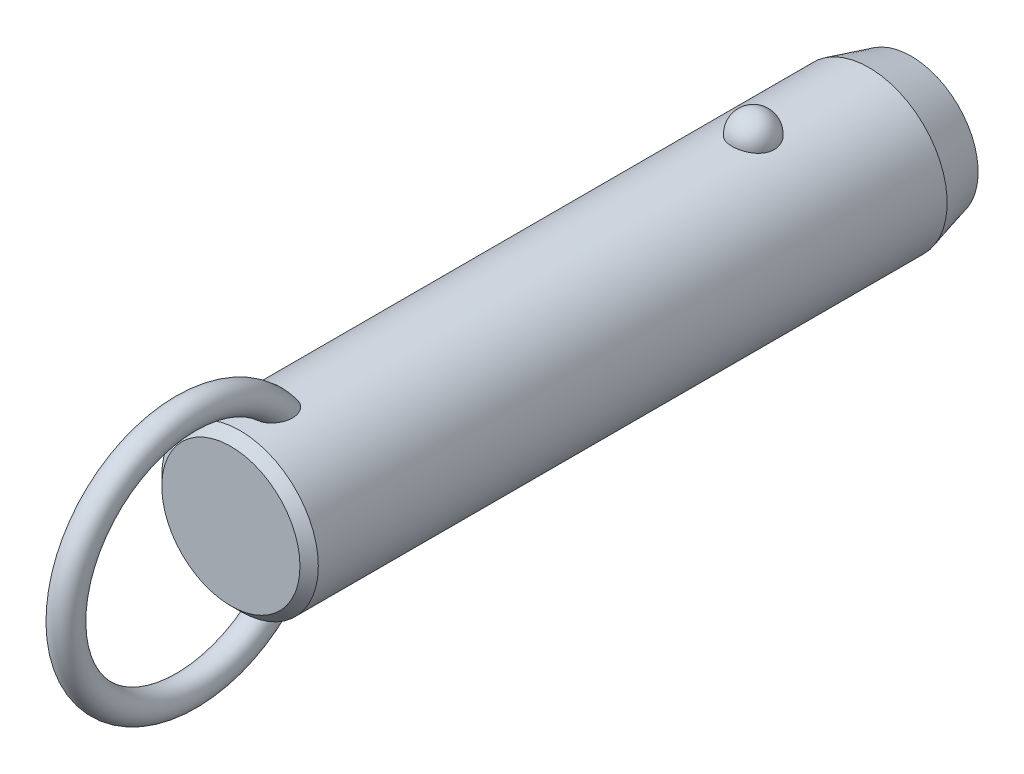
ISO-10303-21;
HEADER;
FILE_DESCRIPTION(('STEP AP214'),'2;1');
FILE_NAME('part.step','',(''),(''),'','','');
FILE_SCHEMA(('AUTOMOTIVE_DESIGN { 1 0 10303 214 1 1 1 1 }'));
ENDSEC;
DATA;
#1=APPLICATION_CONTEXT('core data for automotive mechanical design processes');
#2=APPLICATION_PROTOCOL_DEFINITION('international standard','automotive_design',2000,#1);
#3=PRODUCT_CONTEXT('',#1,'mechanical');
#4=PRODUCT('Part','Part','',(#3));
#5=PRODUCT_RELATED_PRODUCT_CATEGORY('part','',(#4));
#6=PRODUCT_DEFINITION_FORMATION('','',#4);
#7=PRODUCT_DEFINITION_CONTEXT('part definition',#1,'design');
#8=PRODUCT_DEFINITION('design','',#6,#7);
#9=PRODUCT_DEFINITION_SHAPE('','',#8);
#10=(LENGTH_UNIT() NAMED_UNIT(*) SI_UNIT(.MILLI.,.METRE.));
#11=(NAMED_UNIT(*) PLANE_ANGLE_UNIT() SI_UNIT($,.RADIAN.));
#12=(NAMED_UNIT(*) SI_UNIT($,.STERADIAN.) SOLID_ANGLE_UNIT());
#13=UNCERTAINTY_MEASURE_WITH_UNIT(LENGTH_MEASURE(1.E-05),#10,'distance_accuracy_value','');
#14=(GEOMETRIC_REPRESENTATION_CONTEXT(3) GLOBAL_UNCERTAINTY_ASSIGNED_CONTEXT((#13)) GLOBAL_UNIT_ASSIGNED_CONTEXT((#10,
#11,#12)) REPRESENTATION_CONTEXT('',''));
#15=CARTESIAN_POINT('',(0.,0.,0.));
#16=DIRECTION('',(0.,0.,1.));
#17=DIRECTION('',(1.,0.,0.));
#18=AXIS2_PLACEMENT_3D('',#15,#16,#17);
#19=CARTESIAN_POINT('',(0.,0.,58.4));
#20=DIRECTION('',(0.,0.,-1.));
#21=DIRECTION('',(-1.,0.,0.));
#22=AXIS2_PLACEMENT_3D('',#19,#20,#21);
#23=CYLINDRICAL_SURFACE('',#22,11.1);
#24=CARTESIAN_POINT('',(2.9724815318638,10.6945945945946,-3.));
#25=CARTESIAN_POINT('',(2.97247830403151,10.6945972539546,-2.83225059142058));
#26=CARTESIAN_POINT('',(2.95876598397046,10.6984356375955,-2.66445972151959));
#27=CARTESIAN_POINT('',(2.90424529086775,10.7133624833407,-2.33362381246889));
#28=CARTESIAN_POINT('',(2.8634252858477,10.7244540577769,-2.1705808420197));
#29=CARTESIAN_POINT('',(2.75573657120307,10.7526272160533,-1.85396767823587));
#30=CARTESIAN_POINT('',(2.68887937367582,10.7697061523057,-1.70039333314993));
#31=CARTESIAN_POINT('',(2.53079696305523,10.8079438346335,-1.40691598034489));
#32=CARTESIAN_POINT('',(2.43957264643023,10.8291024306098,-1.2670124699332));
#33=CARTESIAN_POINT('',(2.23458150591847,10.8732541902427,-1.00409565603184));
#34=CARTESIAN_POINT('',(2.12071295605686,10.8962553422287,-0.881162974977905));
#35=CARTESIAN_POINT('',(1.87365402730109,10.9414421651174,-0.656352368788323));
#36=CARTESIAN_POINT('',(1.74046358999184,10.9636278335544,-0.554474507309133));
#37=CARTESIAN_POINT('',(1.45872188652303,11.0046495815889,-0.374872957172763));
#38=CARTESIAN_POINT('',(1.31021276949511,11.0234944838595,-0.297085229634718));
#39=CARTESIAN_POINT('',(1.00170030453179,11.0557957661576,-0.167529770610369));
#40=CARTESIAN_POINT('',(0.841698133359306,11.0692526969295,-0.115759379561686));
#41=CARTESIAN_POINT('',(0.517607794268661,11.0890932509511,-0.0403925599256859));
#42=CARTESIAN_POINT('',(0.353633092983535,11.0955916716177,-0.0163383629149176));
#43=CARTESIAN_POINT('',(0.0238420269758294,11.1011989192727,0.0044517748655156));
#44=CARTESIAN_POINT('',(-0.141974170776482,11.1003084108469,0.00119017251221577));
#45=CARTESIAN_POINT('',(-0.468405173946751,11.0912990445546,-0.0323233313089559));
#46=CARTESIAN_POINT('',(-0.629059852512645,11.0832767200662,-0.0622147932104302));
#47=CARTESIAN_POINT('',(-0.942937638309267,11.0609962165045,-0.147645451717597));
#48=CARTESIAN_POINT('',(-1.09616062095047,11.0467379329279,-0.203185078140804));
#49=CARTESIAN_POINT('',(-1.39181061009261,11.0134071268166,-0.3387529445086));
#50=CARTESIAN_POINT('',(-1.53417383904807,10.9943086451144,-0.418913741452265));
#51=CARTESIAN_POINT('',(-1.80342160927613,10.9533667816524,-0.60144882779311));
#52=CARTESIAN_POINT('',(-1.9303046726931,10.9315231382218,-0.703825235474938));
#53=CARTESIAN_POINT('',(-2.16747598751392,10.887005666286,-0.930091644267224));
#54=CARTESIAN_POINT('',(-2.27742774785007,10.8643239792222,-1.05433291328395));
#55=CARTESIAN_POINT('',(-2.47517316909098,10.8209886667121,-1.31966633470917));
#56=CARTESIAN_POINT('',(-2.56296538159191,10.8003351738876,-1.46075958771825));
#57=CARTESIAN_POINT('',(-2.71500300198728,10.7631304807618,-1.75753646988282));
#58=CARTESIAN_POINT('',(-2.77898901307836,10.7466250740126,-1.91335887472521));
#59=CARTESIAN_POINT('',(-2.88046189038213,10.7198747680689,-2.2339152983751));
#60=CARTESIAN_POINT('',(-2.91794947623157,10.709629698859,-2.39864907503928));
#61=CARTESIAN_POINT('',(-2.96537819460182,10.6965949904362,-2.73165170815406));
#62=CARTESIAN_POINT('',(-2.97542891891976,10.693775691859,-2.89990378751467));
#63=CARTESIAN_POINT('',(-2.96804271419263,10.6958279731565,-3.235752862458));
#64=CARTESIAN_POINT('',(-2.95060646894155,10.7006993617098,-3.40334987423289));
#65=CARTESIAN_POINT('',(-2.88883358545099,10.71753912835,-3.73233906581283));
#66=CARTESIAN_POINT('',(-2.84462026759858,10.7294749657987,-3.89375610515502));
#67=CARTESIAN_POINT('',(-2.73050447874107,10.7590797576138,-4.20667949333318));
#68=CARTESIAN_POINT('',(-2.66060103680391,10.7767489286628,-4.35818546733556));
#69=CARTESIAN_POINT('',(-2.49642559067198,10.8159599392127,-4.6478542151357));
#70=CARTESIAN_POINT('',(-2.40203047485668,10.8375211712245,-4.78594458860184));
#71=CARTESIAN_POINT('',(-2.19143488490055,10.8820570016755,-5.0441038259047));
#72=CARTESIAN_POINT('',(-2.07523364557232,10.9050316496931,-5.16417205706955));
#73=CARTESIAN_POINT('',(-1.82361254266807,10.9499219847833,-5.38334833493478));
#74=CARTESIAN_POINT('',(-1.68812945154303,10.9718338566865,-5.48238464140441));
#75=CARTESIAN_POINT('',(-1.40191298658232,11.0120611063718,-5.65618873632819));
#76=CARTESIAN_POINT('',(-1.25118062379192,11.0303767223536,-5.73095813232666));
#77=CARTESIAN_POINT('',(-0.940570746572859,11.0611653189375,-5.85334725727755));
#78=CARTESIAN_POINT('',(-0.780821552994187,11.0737044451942,-5.90127578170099));
#79=CARTESIAN_POINT('',(-0.455204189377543,11.0918598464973,-5.96992976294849));
#80=CARTESIAN_POINT('',(-0.289336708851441,11.0974768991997,-5.99065827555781));
#81=CARTESIAN_POINT('',(0.0406846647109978,11.1011307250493,-6.00418773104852));
#82=CARTESIAN_POINT('',(0.204817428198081,11.099299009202,-5.99747318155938));
#83=CARTESIAN_POINT('',(0.5295530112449,11.088551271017,-5.9574031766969));
#84=CARTESIAN_POINT('',(0.69015594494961,11.0796354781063,-5.92404858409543));
#85=CARTESIAN_POINT('',(1.0027760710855,11.0557204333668,-5.83180084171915));
#86=CARTESIAN_POINT('',(1.15482001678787,11.0407414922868,-5.77299291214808));
#87=CARTESIAN_POINT('',(1.44678373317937,11.0062913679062,-5.63147366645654));
#88=CARTESIAN_POINT('',(1.58670279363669,10.9868199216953,-5.54876095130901));
#89=CARTESIAN_POINT('',(1.8527023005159,10.9451315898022,-5.36027644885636));
#90=CARTESIAN_POINT('',(1.97855158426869,10.9228788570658,-5.25418644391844));
#91=CARTESIAN_POINT('',(2.21080872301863,10.8782509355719,-5.02251354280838));
#92=CARTESIAN_POINT('',(2.31721312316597,10.8558757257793,-4.89692718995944));
#93=CARTESIAN_POINT('',(2.5094551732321,10.8130715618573,-4.62745408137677));
#94=CARTESIAN_POINT('',(2.59493284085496,10.7926798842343,-4.48330448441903));
#95=CARTESIAN_POINT('',(2.740862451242,10.7565495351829,-4.18236358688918));
#96=CARTESIAN_POINT('',(2.80132490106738,10.7408089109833,-4.02557762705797));
#97=CARTESIAN_POINT('',(2.88959070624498,10.7173718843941,-3.72475308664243));
#98=CARTESIAN_POINT('',(2.92062102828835,10.7088950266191,-3.58171216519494));
#99=CARTESIAN_POINT('',(2.96206765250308,10.6975052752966,-3.29245795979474));
#100=CARTESIAN_POINT('',(2.97248434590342,10.6945922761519,-3.14624473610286));
#101=CARTESIAN_POINT('',(2.9724815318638,10.6945945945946,-3.));
#102=B_SPLINE_CURVE_WITH_KNOTS('',3,(#24,#25,#26,#27,#28,#29,#30,#31,#32,#33,#34,#35,#36,#37,
#38,#39,#40,#41,#42,#43,#44,#45,#46,#47,#48,#49,#50,#51,#52,#53,#54,#55,#56,#57,#58,#59,#60,#61,
#62,#63,#64,#65,#66,#67,#68,#69,#70,#71,#72,#73,#74,#75,#76,#77,#78,#79,#80,#81,#82,#83,#84,#85,
#86,#87,#88,#89,#90,#91,#92,#93,#94,#95,#96,#97,#98,#99,#100,#101),.UNSPECIFIED.,.T.,.F.,(4,2,2,
2,2,2,2,2,2,2,2,2,2,2,2,2,2,2,2,2,2,2,2,2,2,2,2,2,2,2,2,2,2,2,2,2,2,2,4),(0.,0.502722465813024,
1.00566079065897,1.5083769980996,2.01107471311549,2.51608392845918,3.02109467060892,
3.52475118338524,4.02835620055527,4.523518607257,5.0186364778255,5.50715297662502,
5.9956776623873,6.48688002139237,6.97812923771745,7.47814366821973,7.9781907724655,
8.48353712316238,8.9888697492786,9.49218093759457,9.99547960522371,10.4964777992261,
10.997494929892,11.5010810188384,12.0046847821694,12.5099796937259,13.0152411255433,
13.5145635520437,14.0138298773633,14.5043200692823,14.9947943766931,15.4836390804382,
15.9725123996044,16.4685040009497,16.9645836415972,17.4686765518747,17.972557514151,
18.410841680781,18.849117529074),.UNSPECIFIED.);
#103=CARTESIAN_POINT('',(2.9724815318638,10.6945945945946,-3.));
#104=VERTEX_POINT('',#103);
#105=EDGE_CURVE('E41',#104,#104,#102,.T.);
#106=ORIENTED_EDGE('',*,*,#105,.T.);
#107=EDGE_LOOP('',(#106));
#108=FACE_BOUND('',#107,.T.);
#109=CARTESIAN_POINT('',(0.,0.,69.8));
#110=DIRECTION('',(0.,0.,1.));
#111=DIRECTION('',(1.,0.,0.));
#112=AXIS2_PLACEMENT_3D('',#109,#110,#111);
#113=CIRCLE('',#112,11.1);
#114=CARTESIAN_POINT('',(11.1,0.,69.8));
#115=VERTEX_POINT('',#114);
#116=EDGE_CURVE('E10',#115,#115,#113,.F.);
#117=ORIENTED_EDGE('',*,*,#116,.T.);
#118=EDGE_LOOP('',(#117));
#119=FACE_BOUND('',#118,.T.);
#120=CARTESIAN_POINT('',(-0.564520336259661,-11.0856356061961,62.0578154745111));
#121=CARTESIAN_POINT('',(-0.667202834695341,-11.0804062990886,62.0912839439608));
#122=CARTESIAN_POINT('',(-0.766875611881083,-11.0738877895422,62.1338357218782));
#123=CARTESIAN_POINT('',(-0.957284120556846,-11.0590576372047,62.2354190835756));
#124=CARTESIAN_POINT('',(-1.04801616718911,-11.0507452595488,62.2944574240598));
#125=CARTESIAN_POINT('',(-1.21800952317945,-11.0333016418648,62.4265293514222));
#126=CARTESIAN_POINT('',(-1.29730805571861,-11.0241732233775,62.4995156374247));
#127=CARTESIAN_POINT('',(-1.44337665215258,-11.0060026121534,62.6570374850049));
#128=CARTESIAN_POINT('',(-1.51014622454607,-10.9969604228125,62.7415734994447));
#129=CARTESIAN_POINT('',(-1.63454620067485,-10.9791841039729,62.9255213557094));
#130=CARTESIAN_POINT('',(-1.69127003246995,-10.9705107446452,63.0255493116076));
#131=CARTESIAN_POINT('',(-1.78980785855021,-10.9548648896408,63.2327902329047));
#132=CARTESIAN_POINT('',(-1.83161214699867,-10.9478935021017,63.3400078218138));
#133=CARTESIAN_POINT('',(-1.91557028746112,-10.9335803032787,63.6054080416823));
#134=CARTESIAN_POINT('',(-1.95040620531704,-10.9273269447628,63.7659806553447));
#135=CARTESIAN_POINT('',(-1.99388326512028,-10.9194709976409,64.0906977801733));
#136=CARTESIAN_POINT('',(-2.00248051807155,-10.9178762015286,64.2548478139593));
#137=CARTESIAN_POINT('',(-1.99551615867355,-10.9191578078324,64.6246504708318));
#138=CARTESIAN_POINT('',(-1.9732206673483,-10.9232807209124,64.8301911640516));
#139=CARTESIAN_POINT('',(-1.91529761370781,-10.9335244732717,65.133595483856));
#140=CARTESIAN_POINT('',(-1.8918457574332,-10.9376266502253,65.2340883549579));
#141=CARTESIAN_POINT('',(-1.83700674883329,-10.9469720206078,65.432855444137));
#142=CARTESIAN_POINT('',(-1.80562070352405,-10.9522150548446,65.5311299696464));
#143=CARTESIAN_POINT('',(-1.73463055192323,-10.9636837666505,65.7259148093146));
#144=CARTESIAN_POINT('',(-1.69493416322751,-10.9699202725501,65.8223907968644));
#145=CARTESIAN_POINT('',(-1.60745141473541,-10.9830806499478,66.0116262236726));
#146=CARTESIAN_POINT('',(-1.55966150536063,-10.9900048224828,66.1043840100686));
#147=CARTESIAN_POINT('',(-1.45591812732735,-11.0042280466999,66.2846907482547));
#148=CARTESIAN_POINT('',(-1.40000013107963,-11.0115253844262,66.3722601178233));
#149=CARTESIAN_POINT('',(-1.27937470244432,-11.0261911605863,66.5410298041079));
#150=CARTESIAN_POINT('',(-1.21467835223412,-11.0335594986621,66.6222379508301));
#151=CARTESIAN_POINT('',(-1.08218150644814,-11.0473027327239,66.7690010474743));
#152=CARTESIAN_POINT('',(-1.01522633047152,-11.0537063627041,66.835309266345));
#153=CARTESIAN_POINT('',(-0.872952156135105,-11.065850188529,66.9583780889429));
#154=CARTESIAN_POINT('',(-0.797642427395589,-11.0715911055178,67.0151491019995));
#155=CARTESIAN_POINT('',(-0.651396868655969,-11.081071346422,67.1075155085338));
#156=CARTESIAN_POINT('',(-0.58171263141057,-11.0849841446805,67.1450491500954));
#157=CARTESIAN_POINT('',(-0.437066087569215,-11.0916271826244,67.2082594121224));
#158=CARTESIAN_POINT('',(-0.362109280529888,-11.0943586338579,67.2339481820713));
#159=CARTESIAN_POINT('',(-0.207828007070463,-11.0983242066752,67.271117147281));
#160=CARTESIAN_POINT('',(-0.128467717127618,-11.0995432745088,67.2824545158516));
#161=CARTESIAN_POINT('',(0.0309101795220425,-11.1002423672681,67.2889658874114));
#162=CARTESIAN_POINT('',(0.110927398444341,-11.0997233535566,67.2841488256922));
#163=CARTESIAN_POINT('',(0.256406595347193,-11.097240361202,67.2609599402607));
#164=CARTESIAN_POINT('',(0.322235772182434,-11.0955074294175,67.2447543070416));
#165=CARTESIAN_POINT('',(0.450635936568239,-11.0910350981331,67.2026008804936));
#166=CARTESIAN_POINT('',(0.513205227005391,-11.0882951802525,67.1766480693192));
#167=CARTESIAN_POINT('',(0.662626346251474,-11.0805620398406,67.1026073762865));
#168=CARTESIAN_POINT('',(0.747127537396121,-11.0751144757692,67.0498452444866));
#169=CARTESIAN_POINT('',(0.906756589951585,-11.0631932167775,66.9317206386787));
#170=CARTESIAN_POINT('',(0.981859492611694,-11.0567168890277,66.8663257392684));
#171=CARTESIAN_POINT('',(1.10712207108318,-11.0447856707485,66.7422633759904));
#172=CARTESIAN_POINT('',(1.15909566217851,-11.0394280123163,66.6853831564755));
#173=CARTESIAN_POINT('',(1.25791923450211,-11.0286040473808,66.5673271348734));
#174=CARTESIAN_POINT('',(1.3047664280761,-11.0231376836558,66.5061490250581));
#175=CARTESIAN_POINT('',(1.43818612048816,-11.0068027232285,66.317305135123));
#176=CARTESIAN_POINT('',(1.5175176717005,-10.9960104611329,66.1844531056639));
#177=CARTESIAN_POINT('',(1.63597546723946,-10.9788847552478,65.9531371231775));
#178=CARTESIAN_POINT('',(1.67988876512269,-10.9722190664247,65.8570530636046));
#179=CARTESIAN_POINT('',(1.75953241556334,-10.9597298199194,65.6614311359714));
#180=CARTESIAN_POINT('',(1.79525967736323,-10.9539065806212,65.5618919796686));
#181=CARTESIAN_POINT('',(1.85844731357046,-10.9433632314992,65.3602111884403));
#182=CARTESIAN_POINT('',(1.88591073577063,-10.9386427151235,65.2580705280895));
#183=CARTESIAN_POINT('',(1.9323432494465,-10.9305350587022,65.0518191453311));
#184=CARTESIAN_POINT('',(1.95131065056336,-10.9271481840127,64.9477080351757));
#185=CARTESIAN_POINT('',(1.99040203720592,-10.9201183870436,64.6654588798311));
#186=CARTESIAN_POINT('',(2.00221217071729,-10.9179256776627,64.4860370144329));
#187=CARTESIAN_POINT('',(1.99711676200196,-10.9188636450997,64.1277133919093));
#188=CARTESIAN_POINT('',(1.98026150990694,-10.9219849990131,63.948811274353));
#189=CARTESIAN_POINT('',(1.92151657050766,-10.9324473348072,63.6364514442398));
#190=CARTESIAN_POINT('',(1.88605081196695,-10.9386915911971,63.5017594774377));
#191=CARTESIAN_POINT('',(1.7939302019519,-10.9541780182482,63.2399669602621));
#192=CARTESIAN_POINT('',(1.73729868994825,-10.9634168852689,63.1128582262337));
#193=CARTESIAN_POINT('',(1.61237037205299,-10.9824218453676,62.8894184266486));
#194=CARTESIAN_POINT('',(1.54715374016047,-10.9918945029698,62.7913455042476));
#195=CARTESIAN_POINT('',(1.40127026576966,-11.0114415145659,62.6074341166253));
#196=CARTESIAN_POINT('',(1.32060742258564,-11.0215157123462,62.5215924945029));
#197=CARTESIAN_POINT('',(1.14474787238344,-11.041168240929,62.3651630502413));
#198=CARTESIAN_POINT('',(1.04947805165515,-11.0507437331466,62.2946565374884));
#199=CARTESIAN_POINT('',(0.847278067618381,-11.0680789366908,62.172640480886));
#200=CARTESIAN_POINT('',(0.740351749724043,-11.0758392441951,62.1211246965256));
#201=CARTESIAN_POINT('',(0.52928931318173,-11.0878275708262,62.0434852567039));
#202=CARTESIAN_POINT('',(0.425895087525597,-11.0923259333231,62.015377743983));
#203=CARTESIAN_POINT('',(0.215723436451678,-11.0984001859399,61.9777038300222));
#204=CARTESIAN_POINT('',(0.108947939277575,-11.0999777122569,61.9681270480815));
#205=CARTESIAN_POINT('',(-0.0938962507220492,-11.1000196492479,61.9678773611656));
#206=CARTESIAN_POINT('',(-0.189967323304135,-11.0987797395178,61.9754089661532));
#207=CARTESIAN_POINT('',(-0.379657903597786,-11.0939111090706,62.0055079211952));
#208=CARTESIAN_POINT('',(-0.473277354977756,-11.0902823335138,62.0280756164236));
#209=CARTESIAN_POINT('',(-0.564520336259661,-11.0856356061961,62.0578154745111));
#210=B_SPLINE_CURVE_WITH_KNOTS('',3,(#120,#121,#122,#123,#124,#125,#126,#127,#128,#129,#130,
#131,#132,#133,#134,#135,#136,#137,#138,#139,#140,#141,#142,#143,#144,#145,#146,#147,#148,#149,
#150,#151,#152,#153,#154,#155,#156,#157,#158,#159,#160,#161,#162,#163,#164,#165,#166,#167,#168,
#169,#170,#171,#172,#173,#174,#175,#176,#177,#178,#179,#180,#181,#182,#183,#184,#185,#186,#187,
#188,#189,#190,#191,#192,#193,#194,#195,#196,#197,#198,#199,#200,#201,#202,#203,#204,#205,#206,
#207,#208,#209),.UNSPECIFIED.,.T.,.F.,(4,2,2,2,2,2,2,2,2,2,2,2,2,2,2,2,2,2,2,2,2,2,2,2,2,2,2,2,
2,2,2,2,2,2,2,2,2,2,2,2,2,2,2,2,4),(0.,0.323999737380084,0.648132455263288,0.971184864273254,
1.29424994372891,1.63886237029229,1.98369857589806,2.47426059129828,2.96564271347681,
3.58257396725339,3.8921525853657,4.20168803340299,4.5148627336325,4.82817514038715,
5.14015911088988,5.45175282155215,5.73442856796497,6.01679375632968,6.25364580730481,
6.49025437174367,6.72919963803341,6.96801276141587,7.17061258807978,7.37331685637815,
7.67094989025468,7.96935728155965,8.20075067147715,8.43226927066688,8.89581623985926,
9.21306533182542,9.530434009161,9.84768549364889,10.1650000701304,10.70229304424,
11.2386443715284,11.6553390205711,12.0715755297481,12.4245637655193,12.7774607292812,
13.1321855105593,13.4867936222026,13.8068771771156,14.1267813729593,14.4146787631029,
14.7025827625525),.UNSPECIFIED.);
#211=CARTESIAN_POINT('',(-0.564520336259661,-11.0856356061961,62.0578154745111));
#212=VERTEX_POINT('',#211);
#213=EDGE_CURVE('E59',#212,#212,#210,.T.);
#214=ORIENTED_EDGE('',*,*,#213,.T.);
#215=EDGE_LOOP('',(#214));
#216=FACE_BOUND('',#215,.T.);
#217=CARTESIAN_POINT('',(-0.564520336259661,11.0856356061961,62.0578154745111));
#218=CARTESIAN_POINT('',(-0.468542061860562,11.0905203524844,62.0265456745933));
#219=CARTESIAN_POINT('',(-0.369793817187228,11.0942886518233,62.0031576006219));
#220=CARTESIAN_POINT('',(-0.16955579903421,11.0991586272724,61.9730858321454));
#221=CARTESIAN_POINT('',(-0.0680604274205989,11.1002543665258,61.9664393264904));
#222=CARTESIAN_POINT('',(0.134549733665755,11.099646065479,61.9701579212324));
#223=CARTESIAN_POINT('',(0.235664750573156,11.0979441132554,61.9805103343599));
#224=CARTESIAN_POINT('',(0.43463240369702,11.0919342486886,62.0178318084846));
#225=CARTESIAN_POINT('',(0.532486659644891,11.0876276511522,62.0447924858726));
#226=CARTESIAN_POINT('',(0.72244585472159,11.0768742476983,62.1144096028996));
#227=CARTESIAN_POINT('',(0.814543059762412,11.0704246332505,62.1570866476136));
#228=CARTESIAN_POINT('',(0.990565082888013,11.0560659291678,62.2566487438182));
#229=CARTESIAN_POINT('',(1.07448844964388,11.048156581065,62.3135363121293));
#230=CARTESIAN_POINT('',(1.23562672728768,11.0313221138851,62.4422106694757));
#231=CARTESIAN_POINT('',(1.31242684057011,11.0223686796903,62.5145117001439));
#232=CARTESIAN_POINT('',(1.45398030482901,11.0045918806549,62.6700425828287));
#233=CARTESIAN_POINT('',(1.51873073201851,10.9957685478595,62.7532750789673));
#234=CARTESIAN_POINT('',(1.64107232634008,10.9782087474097,62.9363842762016));
#235=CARTESIAN_POINT('',(1.69743176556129,10.9695572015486,63.0370893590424));
#236=CARTESIAN_POINT('',(1.79515063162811,10.9539887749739,63.2456264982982));
#237=CARTESIAN_POINT('',(1.83649966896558,10.9470730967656,63.3534634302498));
#238=CARTESIAN_POINT('',(1.91931148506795,10.9329211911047,63.6203995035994));
#239=CARTESIAN_POINT('',(1.95340104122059,10.9267904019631,63.7818612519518));
#240=CARTESIAN_POINT('',(1.99526195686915,10.9192174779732,64.1082163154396));
#241=CARTESIAN_POINT('',(2.00298989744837,10.9177830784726,64.2731148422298));
#242=CARTESIAN_POINT('',(1.99396251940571,10.9194420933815,64.6441006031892));
#243=CARTESIAN_POINT('',(1.97050829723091,10.923774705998,64.8500387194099));
#244=CARTESIAN_POINT('',(1.91079643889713,10.9343131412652,65.1539019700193));
#245=CARTESIAN_POINT('',(1.88673702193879,10.9385106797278,65.2545296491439));
#246=CARTESIAN_POINT('',(1.83065508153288,10.9480376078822,65.4535107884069));
#247=CARTESIAN_POINT('',(1.79863369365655,10.9533668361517,65.551864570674));
#248=CARTESIAN_POINT('',(1.72633365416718,10.9649954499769,65.7467203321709));
#249=CARTESIAN_POINT('',(1.68596409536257,10.9713053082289,65.8431879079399));
#250=CARTESIAN_POINT('',(1.59707998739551,10.9845964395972,66.0323233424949));
#251=CARTESIAN_POINT('',(1.54856169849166,10.9915780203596,66.1249894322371));
#252=CARTESIAN_POINT('',(1.4433016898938,11.0058935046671,66.3049752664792));
#253=CARTESIAN_POINT('',(1.38659749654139,11.0132257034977,66.392316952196));
#254=CARTESIAN_POINT('',(1.26431158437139,11.0279330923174,66.5604563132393));
#255=CARTESIAN_POINT('',(1.198741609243,11.0353082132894,66.6412624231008));
#256=CARTESIAN_POINT('',(1.06542088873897,11.048931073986,66.7859856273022));
#257=CARTESIAN_POINT('',(0.998640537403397,11.0552153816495,66.850784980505));
#258=CARTESIAN_POINT('',(0.856896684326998,11.0671032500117,66.9708462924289));
#259=CARTESIAN_POINT('',(0.781942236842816,11.0727075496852,67.0261186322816));
#260=CARTESIAN_POINT('',(0.63627641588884,11.081949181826,67.1159721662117));
#261=CARTESIAN_POINT('',(0.566755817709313,11.0857572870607,67.1524410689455));
#262=CARTESIAN_POINT('',(0.422602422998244,11.0921860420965,67.2135333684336));
#263=CARTESIAN_POINT('',(0.347974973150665,11.0948079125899,67.2381689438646));
#264=CARTESIAN_POINT('',(0.194593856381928,11.0985608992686,67.2733233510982));
#265=CARTESIAN_POINT('',(0.115807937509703,11.0996777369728,67.2837069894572));
#266=CARTESIAN_POINT('',(-0.042249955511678,11.1002003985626,67.2885747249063));
#267=CARTESIAN_POINT('',(-0.121521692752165,11.09960699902,67.283066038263));
#268=CARTESIAN_POINT('',(-0.266046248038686,11.0970123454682,67.2588271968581));
#269=CARTESIAN_POINT('',(-0.331661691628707,11.0952283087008,67.2421356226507));
#270=CARTESIAN_POINT('',(-0.459588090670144,11.0906663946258,67.1991117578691));
#271=CARTESIAN_POINT('',(-0.521897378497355,11.0878880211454,67.172774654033));
#272=CARTESIAN_POINT('',(-0.671446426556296,11.0800342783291,67.0975130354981));
#273=CARTESIAN_POINT('',(-0.756250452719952,11.0744969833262,67.0438182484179));
#274=CARTESIAN_POINT('',(-0.91634957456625,11.0624045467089,66.9238029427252));
#275=CARTESIAN_POINT('',(-0.991618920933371,11.0558467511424,66.8574493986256));
#276=CARTESIAN_POINT('',(-1.11713140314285,11.0437783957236,66.7316335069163));
#277=CARTESIAN_POINT('',(-1.16920539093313,11.0383619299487,66.6739524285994));
#278=CARTESIAN_POINT('',(-1.26817476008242,11.02743010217,66.5542809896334));
#279=CARTESIAN_POINT('',(-1.315067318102,11.0219146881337,66.4922883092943));
#280=CARTESIAN_POINT('',(-1.40399813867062,11.0109399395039,66.3647843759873));
#281=CARTESIAN_POINT('',(-1.44602864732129,11.0054807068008,66.2992677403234));
#282=CARTESIAN_POINT('',(-1.52538779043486,10.9947621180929,66.1654223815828));
#283=CARTESIAN_POINT('',(-1.56271516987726,10.9895028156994,66.0970929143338));
#284=CARTESIAN_POINT('',(-1.64537943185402,10.9774790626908,65.9332101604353));
#285=CARTESIAN_POINT('',(-1.68879497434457,10.9708503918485,65.8366735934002));
#286=CARTESIAN_POINT('',(-1.76740738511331,10.9584602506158,65.6402369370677));
#287=CARTESIAN_POINT('',(-1.80260120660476,10.95269910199,65.5403356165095));
#288=CARTESIAN_POINT('',(-1.86468657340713,10.9423003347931,65.3379663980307));
#289=CARTESIAN_POINT('',(-1.8915816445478,10.9376622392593,65.2354996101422));
#290=CARTESIAN_POINT('',(-1.93682458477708,10.9297405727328,65.0286429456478));
#291=CARTESIAN_POINT('',(-1.95517082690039,10.9264572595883,64.9242527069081));
#292=CARTESIAN_POINT('',(-1.99232562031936,10.9197647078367,64.6426287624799));
#293=CARTESIAN_POINT('',(-2.00294603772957,10.9177914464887,64.4641857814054));
#294=CARTESIAN_POINT('',(-1.99566675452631,10.9191290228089,64.1079962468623));
#295=CARTESIAN_POINT('',(-1.97781651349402,10.9224306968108,63.9302490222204));
#296=CARTESIAN_POINT('',(-1.91747214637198,10.93315926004,63.6197921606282));
#297=CARTESIAN_POINT('',(-1.88131022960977,10.9395108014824,63.485825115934));
#298=CARTESIAN_POINT('',(-1.78790380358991,10.9551659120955,63.2255975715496));
#299=CARTESIAN_POINT('',(-1.7306830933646,10.9644661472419,63.0993285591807));
#300=CARTESIAN_POINT('',(-1.60475573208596,10.9835398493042,62.8774156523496));
#301=CARTESIAN_POINT('',(-1.53908879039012,10.9930297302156,62.7800265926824));
#302=CARTESIAN_POINT('',(-1.39238608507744,11.0125708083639,62.5975250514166));
#303=CARTESIAN_POINT('',(-1.31135150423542,11.0226219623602,62.5124116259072));
#304=CARTESIAN_POINT('',(-1.14382035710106,11.0411991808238,62.3652994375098));
#305=CARTESIAN_POINT('',(-1.05858500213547,11.0497792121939,62.3018693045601));
#306=CARTESIAN_POINT('',(-0.878723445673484,11.0655285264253,62.1902505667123));
#307=CARTESIAN_POINT('',(-0.784123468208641,11.0727015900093,62.1420208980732));
#308=CARTESIAN_POINT('',(-0.646163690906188,11.0812501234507,62.086023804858));
#309=CARTESIAN_POINT('',(-0.60559567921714,11.0835451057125,62.0711978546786));
#310=CARTESIAN_POINT('',(-0.564520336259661,11.0856356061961,62.0578154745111));
#311=B_SPLINE_CURVE_WITH_KNOTS('',3,(#217,#218,#219,#220,#221,#222,#223,#224,#225,#226,#227,
#228,#229,#230,#231,#232,#233,#234,#235,#236,#237,#238,#239,#240,#241,#242,#243,#244,#245,#246,
#247,#248,#249,#250,#251,#252,#253,#254,#255,#256,#257,#258,#259,#260,#261,#262,#263,#264,#265,
#266,#267,#268,#269,#270,#271,#272,#273,#274,#275,#276,#277,#278,#279,#280,#281,#282,#283,#284,
#285,#286,#287,#288,#289,#290,#291,#292,#293,#294,#295,#296,#297,#298,#299,#300,#301,#302,#303,
#304,#305,#306,#307,#308,#309,#310),.UNSPECIFIED.,.T.,.F.,(4,2,2,2,2,2,2,2,2,2,2,2,2,2,2,2,2,2,
2,2,2,2,2,2,2,2,2,2,2,2,2,2,2,2,2,2,2,2,2,2,2,2,2,2,2,2,4),(0.,0.303061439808,0.60679549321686,
0.91030295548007,1.21365733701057,1.51741085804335,1.82121821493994,2.13745205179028,
2.45376252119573,2.79958678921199,3.14564996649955,3.63832391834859,4.13180893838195,
4.75031912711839,5.06071926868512,5.37107516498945,5.68500772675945,5.99908475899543,
6.31176519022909,6.62403542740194,6.90315673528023,7.18197194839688,7.41687778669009,
7.6515413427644,7.88841587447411,8.12518286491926,8.32752842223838,8.5299750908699,
8.82986421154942,9.13054668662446,9.36393502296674,9.59744991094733,9.83133221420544,
10.0652767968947,10.383032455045,10.7009056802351,11.0186436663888,11.3364420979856,
11.8705925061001,12.4038159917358,12.8189662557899,13.2336487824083,13.5857049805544,
13.9377340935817,14.2561354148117,14.5736690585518,14.7033687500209),.UNSPECIFIED.);
#312=CARTESIAN_POINT('',(-0.564520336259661,11.0856356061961,62.0578154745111));
#313=VERTEX_POINT('',#312);
#314=EDGE_CURVE('E67',#313,#313,#311,.T.);
#315=ORIENTED_EDGE('',*,*,#314,.T.);
#316=EDGE_LOOP('',(#315));
#317=FACE_BOUND('',#316,.T.);
#318=CARTESIAN_POINT('',(0.,0.,-19.3999999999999));
#319=DIRECTION('',(0.,0.,-1.));
#320=DIRECTION('',(-1.,0.,0.));
#321=AXIS2_PLACEMENT_3D('',#318,#319,#320);
#322=CIRCLE('',#321,11.1);
#323=CARTESIAN_POINT('',(-11.1,0.,-19.3999999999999));
#324=VERTEX_POINT('',#323);
#325=EDGE_CURVE('E56',#324,#324,#322,.F.);
#326=ORIENTED_EDGE('',*,*,#325,.T.);
#327=EDGE_LOOP('',(#326));
#328=FACE_BOUND('',#327,.T.);
#329=ADVANCED_FACE('F37',(#108,#119,#216,#317,#328),#23,.T.);
#330=CARTESIAN_POINT('',(0.,0.,-25.4));
#331=DIRECTION('',(0.,0.,-1.));
#332=DIRECTION('',(-1.,0.,0.));
#333=AXIS2_PLACEMENT_3D('',#330,#331,#332);
#334=PLANE('',#333);
#335=CARTESIAN_POINT('',(0.,0.,-25.4));
#336=DIRECTION('',(0.,0.,-1.));
#337=DIRECTION('',(-1.,0.,0.));
#338=AXIS2_PLACEMENT_3D('',#335,#336,#337);
#339=CIRCLE('',#338,9.49230484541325);
#340=CARTESIAN_POINT('',(-9.49230484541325,0.,-25.4));
#341=VERTEX_POINT('',#340);
#342=EDGE_CURVE('E66',#341,#341,#339,.T.);
#343=ORIENTED_EDGE('',*,*,#342,.T.);
#344=EDGE_LOOP('',(#343));
#345=FACE_BOUND('',#344,.T.);
#346=ADVANCED_FACE('F85',(#345),#334,.T.);
#347=CARTESIAN_POINT('',(0.,0.,-25.4));
#348=DIRECTION('',(0.,0.,1.));
#349=DIRECTION('',(1.,0.,0.));
#350=AXIS2_PLACEMENT_3D('',#347,#348,#349);
#351=CONICAL_SURFACE('',#350,9.49230484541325,0.261799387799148);
#352=ORIENTED_EDGE('',*,*,#325,.F.);
#353=EDGE_LOOP('',(#352));
#354=FACE_BOUND('',#353,.T.);
#355=ORIENTED_EDGE('',*,*,#342,.F.);
#356=EDGE_LOOP('',(#355));
#357=FACE_BOUND('',#356,.T.);
#358=ADVANCED_FACE('F83',(#354,#357),#351,.T.);
#359=CARTESIAN_POINT('',(0.,0.,71.1));
#360=DIRECTION('',(0.,0.,1.));
#361=DIRECTION('',(1.,0.,0.));
#362=AXIS2_PLACEMENT_3D('',#359,#360,#361);
#363=PLANE('',#362);
#364=CARTESIAN_POINT('',(0.,0.,71.1));
#365=DIRECTION('',(0.,0.,1.));
#366=DIRECTION('',(1.,0.,0.));
#367=AXIS2_PLACEMENT_3D('',#364,#365,#366);
#368=CIRCLE('',#367,9.79999999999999);
#369=CARTESIAN_POINT('',(9.79999999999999,0.,71.1));
#370=VERTEX_POINT('',#369);
#371=EDGE_CURVE('E50',#370,#370,#368,.T.);
#372=ORIENTED_EDGE('',*,*,#371,.T.);
#373=EDGE_LOOP('',(#372));
#374=FACE_BOUND('',#373,.T.);
#375=ADVANCED_FACE('F77',(#374),#363,.T.);
#376=CARTESIAN_POINT('',(0.,0.,77.45));
#377=DIRECTION('',(1.,0.,0.));
#378=DIRECTION('',(0.,0.,-1.));
#379=AXIS2_PLACEMENT_3D('',#376,#377,#378);
#380=TOROIDAL_SURFACE('',#379,17.05,2.);
#381=ORIENTED_EDGE('',*,*,#314,.F.);
#382=EDGE_LOOP('',(#381));
#383=FACE_BOUND('',#382,.T.);
#384=ORIENTED_EDGE('',*,*,#213,.F.);
#385=EDGE_LOOP('',(#384));
#386=FACE_BOUND('',#385,.T.);
#387=ADVANCED_FACE('F73',(#383,#386),#380,.T.);
#388=CARTESIAN_POINT('',(0.,0.,71.1));
#389=DIRECTION('',(0.,0.,-1.));
#390=DIRECTION('',(-1.,0.,0.));
#391=AXIS2_PLACEMENT_3D('',#388,#389,#390);
#392=CONICAL_SURFACE('',#391,9.79999999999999,0.785398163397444);
#393=ORIENTED_EDGE('',*,*,#116,.F.);
#394=EDGE_LOOP('',(#393));
#395=FACE_BOUND('',#394,.T.);
#396=ORIENTED_EDGE('',*,*,#371,.F.);
#397=EDGE_LOOP('',(#396));
#398=FACE_BOUND('',#397,.T.);
#399=ADVANCED_FACE('F39',(#395,#398),#392,.T.);
#400=CARTESIAN_POINT('',(0.,11.1,-3.));
#401=DIRECTION('',(0.,1.,0.));
#402=DIRECTION('',(0.,0.,-1.));
#403=AXIS2_PLACEMENT_3D('',#400,#401,#402);
#404=SPHERICAL_SURFACE('',#403,3.);
#405=ORIENTED_EDGE('',*,*,#105,.F.);
#406=EDGE_LOOP('',(#405));
#407=FACE_BOUND('',#406,.T.);
#408=ADVANCED_FACE('F79',(#407),#404,.T.);
#409=CLOSED_SHELL('',(#329,#346,#358,#375,#387,#399,#408));
#410=MANIFOLD_SOLID_BREP('B2',#409);
#411=ADVANCED_BREP_SHAPE_REPRESENTATION('',(#18,#410),#14);
#412=SHAPE_DEFINITION_REPRESENTATION(#9,#411);
ENDSEC;
END-ISO-10303-21;
